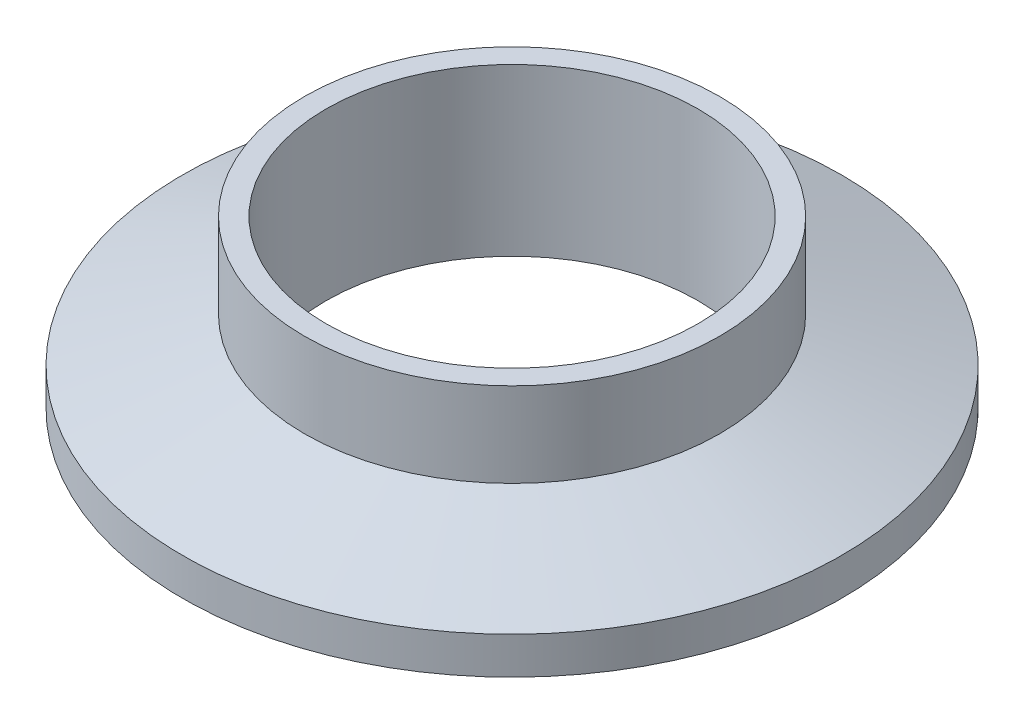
from build123d import *


with BuildPart() as part:
    # Sketch1 → Revolve2 (revolve)
    with BuildSketch(Plane.XY, mode=Mode.PRIVATE) as revolve2_sk:
        with BuildLine():
            Line((-14.224, 0), (-14.224, 12.7))
            Line((-14.224, 12.7), (-15.875, 12.7))
            Line((-15.875, 12.7), (-15.875, 6.23765773))
            Line((-15.875, 6.23765773), (-25.1968, 2.8448))
            Line((-25.1968, 2.8448), (-25.1968, 0))
            Line((-25.1968, 0), (-23.952159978, 0))
            ThreePointArc((-23.952159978, 0), (-23.531583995, 0.126579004), (-23.25073528, 0.46426288))
            Line((-23.25073528, 0.46426288), (-23.077298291, 0.872854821))
            ThreePointArc((-23.077298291, 0.872854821), (-22.04021236, 1.598598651), (-20.933632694, 0.983998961))
            Line((-20.933632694, 0.983998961), (-20.713017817, 0.46426288))
            ThreePointArc((-20.713017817, 0.46426288), (-20.432169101, 0.126579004), (-20.011593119, 0))
            Line((-20.011593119, 0), (-14.224, 0))
        make_face()
    revolve(revolve2_sk.sketch.rotate(Axis((0, 0, 0), (0, 1, 0)), 270), axis=Axis((0, 0, 0), (0, 1, 0)))


solid = part.part
